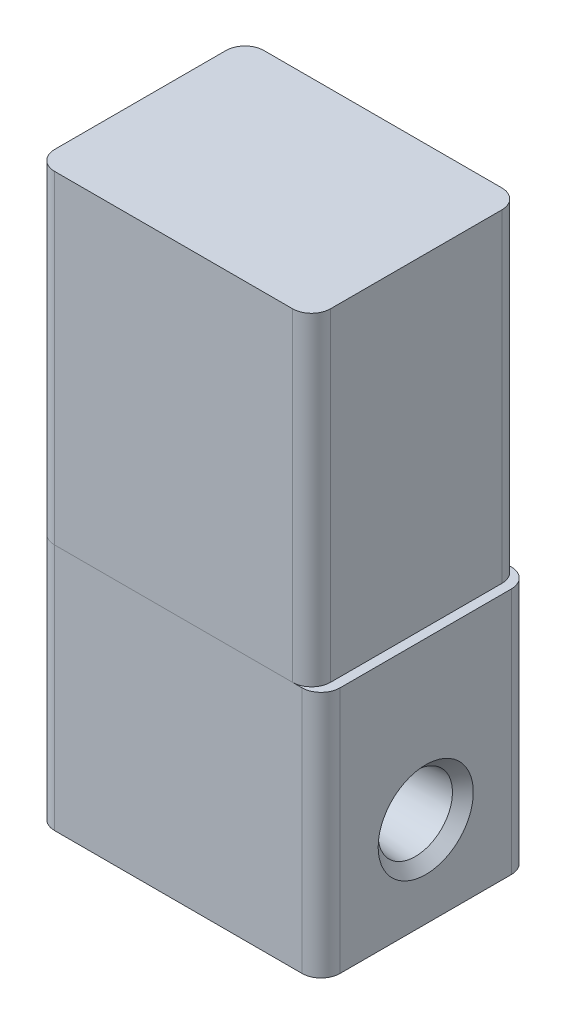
from build123d import *
from OCP.BRepFilletAPI import BRepFilletAPI_MakeChamfer

# Parameters (mm, degrees)
SKETCH1_W               = 30
SKETCH1_H               = 22
BOSS_EXTRUDE1_DEPTH     = 26
SKETCH2_R               = 2
CUT_EXTRUDE1_DEPTH      = 4
SKETCH5_R               = 4
CUT_EXTRUDE2_DEPTH      = 10
CUT_EXTRUDE2_DRAFT      = -5
MIRROR2_COPY_1_SKETCH_R = 4
MIRROR2_COPY_1_DEPTH    = 10
MIRROR2_COPY_1_DRAFT    = -5
CHAMFER1_SIZE           = 1
CHAMFER1_SIZE2          = 1.100062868
FILLET1_R               = 2
SKETCH6_W               = 29
SKETCH6_H               = 22
BOSS_EXTRUDE2_DEPTH     = 34
FILLET2_R               = 2


with BuildPart() as part:
    # Sketch1 → Boss-Extrude1 (new body)
    with BuildSketch(Plane(origin=(0, 0, 0), x_dir=(1, 0, 0), z_dir=(0, 1, 0))):
        Rectangle(SKETCH1_W, SKETCH1_H)
    extrude(amount=BOSS_EXTRUDE1_DEPTH)

    # Sketch2 → Cut-Extrude1 (cut)
    with BuildSketch(Plane.XZ):
        with Locations(Location((10, 7.5, 0), (0, 0, 270))):
            Circle(SKETCH2_R)
        with Locations(Location((10, -7.5, 0), (0, 0, 270))):
            Circle(SKETCH2_R)
    extrude(amount=-CUT_EXTRUDE1_DEPTH, mode=Mode.SUBTRACT)


with BuildPart() as cut_extrude2_tool:
    # Sketch5 → Cut-Extrude2 (with draft: the straight prism first)
    with BuildSketch(Plane(origin=(15, 0, 0), x_dir=(0, 0, -1), z_dir=(1, 0, 0))):
        with Locations((0, 9.5)):
            Circle(SKETCH5_R)
    extrude(amount=-CUT_EXTRUDE2_DEPTH)
    # Cut-Extrude2: the draft: its side faces are tilted about the plane it starts from
    cut_extrude2_sides = [cut_extrude2_tool.faces().sort_by_distance(p)[0] for p in [
        (10, 9.5, 4),
    ]]
    draft(cut_extrude2_sides, Plane(origin=(15, 0, 0), x_dir=(0, 0, -1), z_dir=(1, 0, 0)), CUT_EXTRUDE2_DRAFT)


with BuildPart() as part_1:
    add(part.part)

    # Cut-Extrude2: cut by cut_extrude2_tool
    add(cut_extrude2_tool.part, mode=Mode.SUBTRACT)


with BuildPart() as mirror2_copy_1_tool:
    # Mirror2 copy 1 sketch → Mirror2 copy 1 (with draft: the straight prism first)
    with BuildSketch(Plane(origin=(-15, 0, 0), x_dir=(0, 0, -1), z_dir=(-1, 0, 0))):
        with Locations((0, -9.5)):
            Circle(MIRROR2_COPY_1_SKETCH_R)
    extrude(amount=-MIRROR2_COPY_1_DEPTH)
    # Mirror2 copy 1: the draft: its side faces are tilted about the plane it starts from
    mirror2_copy_1_sides = [mirror2_copy_1_tool.faces().sort_by_distance(p)[0] for p in [
        (-10, 9.5, 4),
    ]]
    draft(mirror2_copy_1_sides, Plane(origin=(-15, 0, 0), x_dir=(0, 0, -1), z_dir=(-1, 0, 0)), MIRROR2_COPY_1_DRAFT)


with BuildPart() as part_2:
    add(part_1.part)

    # Mirror2 copy 1: cut by mirror2_copy_1_tool
    add(mirror2_copy_1_tool.part, mode=Mode.SUBTRACT)

    # Chamfer1: one chamfer whose edges measure the first distance from different faces: ONE call of the kernel's chamfer builder (chamfer() names one face for all edges)
    chamfer1_edges_1 = [part_2.edges().sort_by_distance(p)[0] for p in [
        (5, 9.5, 3.125113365),
    ]]
    chamfer1_side_1 = [part_2.faces().sort_by_distance(p)[0] for p in [
        (10, 9.5, 3.562556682),
    ]]
    chamfer1_edges_2 = [part_2.edges().sort_by_distance(p)[0] for p in [
        (15, 9.5, 4),
    ]]
    chamfer1_side_2 = [part_2.faces().sort_by_distance(p)[0] for p in [
        (15, 13, 10.659412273),
    ]]
    chamfer1_edges_3 = [part_2.edges().sort_by_distance(p)[0] for p in [
        (-15, 9.5, 4),
    ]]
    chamfer1_side_3 = [part_2.faces().sort_by_distance(p)[0] for p in [
        (-10, 9.5, 3.562556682),
    ]]
    chamfer1_edges_4 = [part_2.edges().sort_by_distance(p)[0] for p in [
        (-5, 9.5, 3.125113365),
    ]]
    chamfer1_side_4 = [part_2.faces().sort_by_distance(p)[0] for p in [
        (-5, 9.5, 0),
    ]]
    chamfer1 = BRepFilletAPI_MakeChamfer(part_2.part.solid().wrapped)
    for e in chamfer1_edges_1:
        chamfer1.Add(CHAMFER1_SIZE, CHAMFER1_SIZE2, e.wrapped, chamfer1_side_1[0].wrapped)  # the first distance lies on this face
    for e in chamfer1_edges_2:
        chamfer1.Add(CHAMFER1_SIZE, CHAMFER1_SIZE2, e.wrapped, chamfer1_side_2[0].wrapped)  # the first distance lies on this face
    for e in chamfer1_edges_3:
        chamfer1.Add(CHAMFER1_SIZE, CHAMFER1_SIZE2, e.wrapped, chamfer1_side_3[0].wrapped)  # the first distance lies on this face
    for e in chamfer1_edges_4:
        chamfer1.Add(CHAMFER1_SIZE, CHAMFER1_SIZE2, e.wrapped, chamfer1_side_4[0].wrapped)  # the first distance lies on this face
    add(Compound.cast(chamfer1.Shape()), mode=Mode.REPLACE)

    # Fillet1
    fillet1_edges = [part_2.edges().sort_by_distance(p)[0] for p in [
        (15, 13, 11),
        (-15, 13, 11),
        (-15, 13, -11),
        (15, 13, -11),
    ]]
    fillet(fillet1_edges, radius=FILLET1_R)


with BuildPart() as body_2:
    # Sketch6 → Boss-Extrude2 (new body)
    with BuildSketch(Plane(origin=(0, 26, 0), x_dir=(1, 0, 0), z_dir=(0, 1, 0))):
        with Locations((-0.5, 0)):
            Rectangle(SKETCH6_W, SKETCH6_H)
    extrude(amount=BOSS_EXTRUDE2_DEPTH)

    # Fillet2
    fillet2_edges = [body_2.edges().sort_by_distance(p)[0] for p in [
        (-15, 43, -11),
        (14, 43, -11),
        (14, 43, 11),
        (-15, 43, 11),
    ]]
    fillet(fillet2_edges, radius=FILLET2_R)


solid = Compound([part_2.part, body_2.part])
